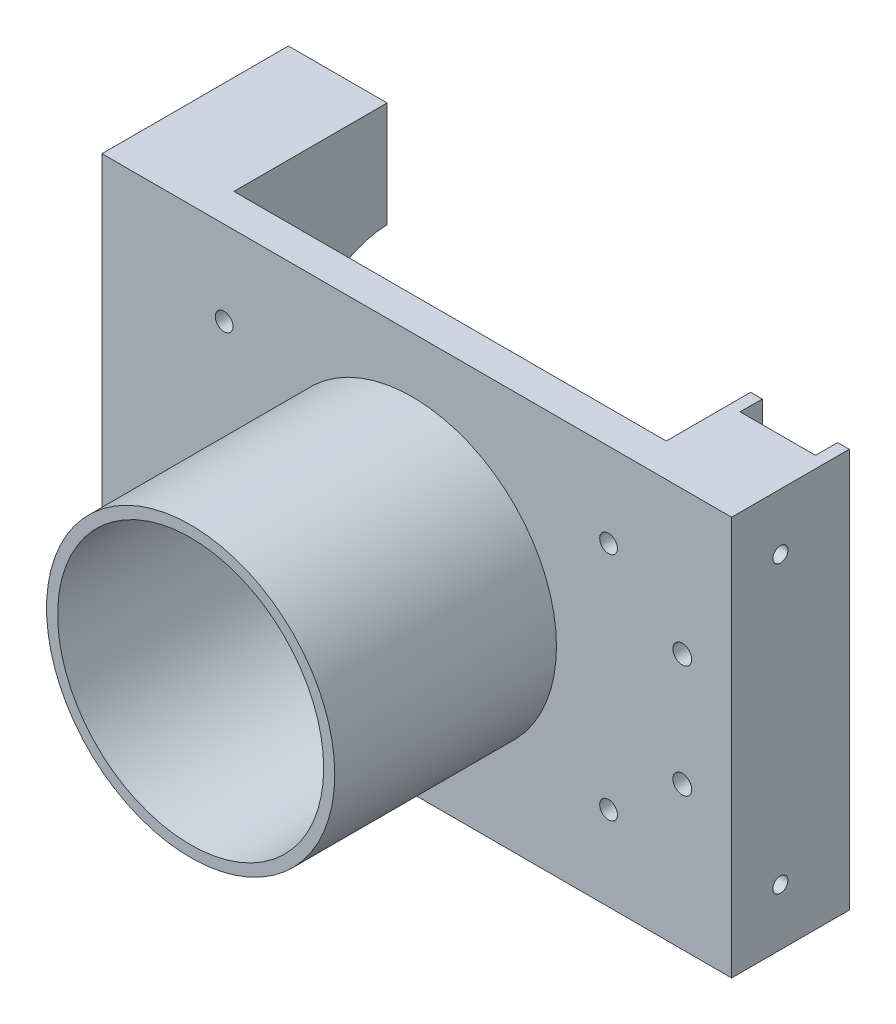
ISO-10303-21;
HEADER;
FILE_DESCRIPTION(('STEP AP214'),'2;1');
FILE_NAME('part.step','',(''),(''),'','','');
FILE_SCHEMA(('AUTOMOTIVE_DESIGN { 1 0 10303 214 1 1 1 1 }'));
ENDSEC;
DATA;
#1=APPLICATION_CONTEXT('core data for automotive mechanical design processes');
#2=APPLICATION_PROTOCOL_DEFINITION('international standard','automotive_design',2000,#1);
#3=PRODUCT_CONTEXT('',#1,'mechanical');
#4=PRODUCT('Part','Part','',(#3));
#5=PRODUCT_RELATED_PRODUCT_CATEGORY('part','',(#4));
#6=PRODUCT_DEFINITION_FORMATION('','',#4);
#7=PRODUCT_DEFINITION_CONTEXT('part definition',#1,'design');
#8=PRODUCT_DEFINITION('design','',#6,#7);
#9=PRODUCT_DEFINITION_SHAPE('','',#8);
#10=(LENGTH_UNIT() NAMED_UNIT(*) SI_UNIT(.MILLI.,.METRE.));
#11=(NAMED_UNIT(*) PLANE_ANGLE_UNIT() SI_UNIT($,.RADIAN.));
#12=(NAMED_UNIT(*) SI_UNIT($,.STERADIAN.) SOLID_ANGLE_UNIT());
#13=UNCERTAINTY_MEASURE_WITH_UNIT(LENGTH_MEASURE(1.E-05),#10,'distance_accuracy_value','');
#14=(GEOMETRIC_REPRESENTATION_CONTEXT(3) GLOBAL_UNCERTAINTY_ASSIGNED_CONTEXT((#13)) GLOBAL_UNIT_ASSIGNED_CONTEXT((#10,
#11,#12)) REPRESENTATION_CONTEXT('',''));
#15=CARTESIAN_POINT('',(0.,0.,0.));
#16=DIRECTION('',(0.,0.,1.));
#17=DIRECTION('',(1.,0.,0.));
#18=AXIS2_PLACEMENT_3D('',#15,#16,#17);
#19=CARTESIAN_POINT('',(140.,90.,153.07));
#20=DIRECTION('',(0.,0.,1.));
#21=DIRECTION('',(1.,0.,0.));
#22=AXIS2_PLACEMENT_3D('',#19,#20,#21);
#23=PLANE('',#22);
#24=CARTESIAN_POINT('',(140.,90.,153.07));
#25=DIRECTION('',(0.,0.,1.));
#26=DIRECTION('',(1.,0.,0.));
#27=AXIS2_PLACEMENT_3D('',#24,#25,#26);
#28=CIRCLE('',#27,65.);
#29=CARTESIAN_POINT('',(205.,90.,153.07));
#30=VERTEX_POINT('',#29);
#31=EDGE_CURVE('E12',#30,#30,#28,.T.);
#32=ORIENTED_EDGE('',*,*,#31,.T.);
#33=EDGE_LOOP('',(#32));
#34=FACE_BOUND('',#33,.T.);
#35=CARTESIAN_POINT('',(140.,90.,153.07));
#36=DIRECTION('',(0.,0.,1.));
#37=DIRECTION('',(1.,0.,0.));
#38=AXIS2_PLACEMENT_3D('',#35,#36,#37);
#39=CIRCLE('',#38,60.);
#40=CARTESIAN_POINT('',(200.,90.,153.07));
#41=VERTEX_POINT('',#40);
#42=EDGE_CURVE('E63',#41,#41,#39,.T.);
#43=ORIENTED_EDGE('',*,*,#42,.F.);
#44=EDGE_LOOP('',(#43));
#45=FACE_BOUND('',#44,.T.);
#46=ADVANCED_FACE('F50',(#34,#45),#23,.T.);
#47=CARTESIAN_POINT('',(140.,90.,53.07));
#48=DIRECTION('',(0.,0.,1.));
#49=DIRECTION('',(1.,0.,0.));
#50=AXIS2_PLACEMENT_3D('',#47,#48,#49);
#51=PLANE('',#50);
#52=CARTESIAN_POINT('',(140.,90.,53.07));
#53=DIRECTION('',(0.,0.,1.));
#54=DIRECTION('',(1.,0.,0.));
#55=AXIS2_PLACEMENT_3D('',#52,#53,#54);
#56=CIRCLE('',#55,65.);
#57=CARTESIAN_POINT('',(205.,90.,53.07));
#58=VERTEX_POINT('',#57);
#59=EDGE_CURVE('E58',#58,#58,#56,.T.);
#60=ORIENTED_EDGE('',*,*,#59,.F.);
#61=EDGE_LOOP('',(#60));
#62=FACE_BOUND('',#61,.T.);
#63=CARTESIAN_POINT('',(140.,90.,53.07));
#64=DIRECTION('',(0.,0.,1.));
#65=DIRECTION('',(1.,0.,0.));
#66=AXIS2_PLACEMENT_3D('',#63,#64,#65);
#67=CIRCLE('',#66,58.2544935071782);
#68=CARTESIAN_POINT('',(198.254493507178,90.,53.07));
#69=VERTEX_POINT('',#68);
#70=EDGE_CURVE('E54',#69,#69,#67,.T.);
#71=ORIENTED_EDGE('',*,*,#70,.T.);
#72=EDGE_LOOP('',(#71));
#73=FACE_BOUND('',#72,.T.);
#74=ADVANCED_FACE('F71',(#62,#73),#51,.F.);
#75=CARTESIAN_POINT('',(140.,90.,153.07));
#76=DIRECTION('',(0.,0.,-1.));
#77=DIRECTION('',(-1.,0.,0.));
#78=AXIS2_PLACEMENT_3D('',#75,#76,#77);
#79=CYLINDRICAL_SURFACE('',#78,65.);
#80=ORIENTED_EDGE('',*,*,#31,.F.);
#81=EDGE_LOOP('',(#80));
#82=FACE_BOUND('',#81,.T.);
#83=ORIENTED_EDGE('',*,*,#59,.T.);
#84=EDGE_LOOP('',(#83));
#85=FACE_BOUND('',#84,.T.);
#86=ADVANCED_FACE('F74',(#82,#85),#79,.T.);
#87=CARTESIAN_POINT('',(140.,90.,153.07));
#88=DIRECTION('',(0.,0.,1.));
#89=DIRECTION('',(1.,0.,0.));
#90=AXIS2_PLACEMENT_3D('',#87,#88,#89);
#91=CONICAL_SURFACE('',#90,60.,0.0174532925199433);
#92=ORIENTED_EDGE('',*,*,#42,.T.);
#93=EDGE_LOOP('',(#92));
#94=FACE_BOUND('',#93,.T.);
#95=ORIENTED_EDGE('',*,*,#70,.F.);
#96=EDGE_LOOP('',(#95));
#97=FACE_BOUND('',#96,.T.);
#98=ADVANCED_FACE('F52',(#94,#97),#91,.F.);
#99=CLOSED_SHELL('',(#46,#74,#86,#98));
#100=MANIFOLD_SOLID_BREP('B2',#99);
#101=CARTESIAN_POINT('',(284.001025,90.,-32.93));
#102=DIRECTION('',(-1.,0.,0.));
#103=DIRECTION('',(0.,0.,1.));
#104=AXIS2_PLACEMENT_3D('',#101,#102,#103);
#105=CYLINDRICAL_SURFACE('',#104,42.5);
#106=CARTESIAN_POINT('',(0.,90.,-32.93));
#107=DIRECTION('',(-1.,0.,0.));
#108=DIRECTION('',(0.,0.,1.));
#109=AXIS2_PLACEMENT_3D('',#106,#107,#108);
#110=CIRCLE('',#109,42.5);
#111=CARTESIAN_POINT('',(0.,47.5422683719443,-31.035));
#112=VERTEX_POINT('',#111);
#113=CARTESIAN_POINT('',(0.,85.,9.27485754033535));
#114=VERTEX_POINT('',#113);
#115=EDGE_CURVE('E327',#112,#114,#110,.T.);
#116=ORIENTED_EDGE('',*,*,#115,.T.);
#117=DIRECTION('',(-1.,0.,0.));
#118=VECTOR('',#117,1.);
#119=CARTESIAN_POINT('',(284.001025,85.,9.27485754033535));
#120=LINE('',#119,#118);
#121=CARTESIAN_POINT('',(44.5,85.,9.27485754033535));
#122=VERTEX_POINT('',#121);
#123=EDGE_CURVE('E297',#122,#114,#120,.T.);
#124=ORIENTED_EDGE('',*,*,#123,.F.);
#125=CARTESIAN_POINT('',(44.5,90.,-32.93));
#126=DIRECTION('',(-1.,0.,0.));
#127=DIRECTION('',(0.,-1.,0.));
#128=AXIS2_PLACEMENT_3D('',#125,#126,#127);
#129=CIRCLE('',#128,42.5);
#130=CARTESIAN_POINT('',(44.5,47.5422683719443,-31.035));
#131=VERTEX_POINT('',#130);
#132=EDGE_CURVE('E326',#122,#131,#129,.F.);
#133=ORIENTED_EDGE('',*,*,#132,.T.);
#134=DIRECTION('',(-1.,0.,0.));
#135=VECTOR('',#134,1.);
#136=CARTESIAN_POINT('',(284.001025,47.5422683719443,-31.035));
#137=LINE('',#136,#135);
#138=EDGE_CURVE('E330',#112,#131,#137,.F.);
#139=ORIENTED_EDGE('',*,*,#138,.F.);
#140=EDGE_LOOP('',(#116,#124,#133,#139));
#141=FACE_BOUND('',#140,.T.);
#142=ADVANCED_FACE('F112',(#141),#105,.F.);
#143=CARTESIAN_POINT('',(227.155881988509,180.,-31.035));
#144=DIRECTION('',(0.,0.,-1.));
#145=DIRECTION('',(0.,1.,0.));
#146=AXIS2_PLACEMENT_3D('',#143,#144,#145);
#147=PLANE('',#146);
#148=CARTESIAN_POINT('',(22.25,23.7722683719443,-31.035));
#149=DIRECTION('',(0.,0.,-1.));
#150=DIRECTION('',(0.,1.,0.));
#151=AXIS2_PLACEMENT_3D('',#148,#149,#150);
#152=CIRCLE('',#151,3.4);
#153=CARTESIAN_POINT('',(22.25,27.1722683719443,-31.035));
#154=VERTEX_POINT('',#153);
#155=EDGE_CURVE('E284',#154,#154,#152,.T.);
#156=ORIENTED_EDGE('',*,*,#155,.F.);
#157=EDGE_LOOP('',(#156));
#158=FACE_BOUND('',#157,.T.);
#159=ORIENTED_EDGE('',*,*,#138,.T.);
#160=DIRECTION('',(0.,1.,0.));
#161=VECTOR('',#160,1.);
#162=CARTESIAN_POINT('',(44.5,180.,-31.035));
#163=LINE('',#162,#161);
#164=CARTESIAN_POINT('',(44.5,0.,-31.035));
#165=VERTEX_POINT('',#164);
#166=EDGE_CURVE('E335',#165,#131,#163,.T.);
#167=ORIENTED_EDGE('',*,*,#166,.F.);
#168=DIRECTION('',(-1.,0.,0.));
#169=VECTOR('',#168,1.);
#170=CARTESIAN_POINT('',(227.155881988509,0.,-31.035));
#171=LINE('',#170,#169);
#172=CARTESIAN_POINT('',(0.,0.,-31.035));
#173=VERTEX_POINT('',#172);
#174=EDGE_CURVE('E416',#165,#173,#171,.T.);
#175=ORIENTED_EDGE('',*,*,#174,.T.);
#176=DIRECTION('',(0.,-1.,0.));
#177=VECTOR('',#176,1.);
#178=CARTESIAN_POINT('',(0.,180.,-31.035));
#179=LINE('',#178,#177);
#180=EDGE_CURVE('E325',#112,#173,#179,.T.);
#181=ORIENTED_EDGE('',*,*,#180,.F.);
#182=EDGE_LOOP('',(#159,#167,#175,#181));
#183=FACE_BOUND('',#182,.T.);
#184=ADVANCED_FACE('F423',(#158,#183),#147,.T.);
#185=CARTESIAN_POINT('',(0.,0.,53.07));
#186=DIRECTION('',(1.,0.,0.));
#187=DIRECTION('',(0.,0.,-1.));
#188=AXIS2_PLACEMENT_3D('',#185,#186,#187);
#189=PLANE('',#188);
#190=DIRECTION('',(0.,1.,0.));
#191=VECTOR('',#190,1.);
#192=CARTESIAN_POINT('',(0.,95.,14.2748575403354));
#193=LINE('',#192,#191);
#194=CARTESIAN_POINT('',(0.,85.,14.2748575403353));
#195=VERTEX_POINT('',#194);
#196=CARTESIAN_POINT('',(0.,95.,14.2748575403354));
#197=VERTEX_POINT('',#196);
#198=EDGE_CURVE('E312',#195,#197,#193,.T.);
#199=ORIENTED_EDGE('',*,*,#198,.F.);
#200=DIRECTION('',(0.,0.,1.));
#201=VECTOR('',#200,1.);
#202=CARTESIAN_POINT('',(0.,85.,9.27485754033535));
#203=LINE('',#202,#201);
#204=EDGE_CURVE('E309',#114,#195,#203,.T.);
#205=ORIENTED_EDGE('',*,*,#204,.F.);
#206=ORIENTED_EDGE('',*,*,#115,.F.);
#207=ORIENTED_EDGE('',*,*,#180,.T.);
#208=DIRECTION('',(0.,0.,-1.));
#209=VECTOR('',#208,1.);
#210=CARTESIAN_POINT('',(0.,0.,53.07));
#211=LINE('',#210,#209);
#212=CARTESIAN_POINT('',(0.,0.,53.07));
#213=VERTEX_POINT('',#212);
#214=EDGE_CURVE('E121',#213,#173,#211,.T.);
#215=ORIENTED_EDGE('',*,*,#214,.F.);
#216=DIRECTION('',(0.,-1.,0.));
#217=VECTOR('',#216,1.);
#218=CARTESIAN_POINT('',(0.,0.,53.07));
#219=LINE('',#218,#217);
#220=CARTESIAN_POINT('',(0.,180.,53.07));
#221=VERTEX_POINT('',#220);
#222=EDGE_CURVE('E386',#221,#213,#219,.T.);
#223=ORIENTED_EDGE('',*,*,#222,.F.);
#224=DIRECTION('',(0.,0.,-1.));
#225=VECTOR('',#224,1.);
#226=CARTESIAN_POINT('',(0.,180.,53.07));
#227=LINE('',#226,#225);
#228=CARTESIAN_POINT('',(0.,180.,-31.035));
#229=VERTEX_POINT('',#228);
#230=EDGE_CURVE('E395',#221,#229,#227,.T.);
#231=ORIENTED_EDGE('',*,*,#230,.T.);
#232=CARTESIAN_POINT('',(0.,132.457731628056,-31.035));
#233=VERTEX_POINT('',#232);
#234=EDGE_CURVE('E342',#229,#233,#179,.T.);
#235=ORIENTED_EDGE('',*,*,#234,.T.);
#236=CARTESIAN_POINT('',(0.,95.,9.27485754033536));
#237=VERTEX_POINT('',#236);
#238=EDGE_CURVE('E136',#237,#233,#110,.T.);
#239=ORIENTED_EDGE('',*,*,#238,.F.);
#240=DIRECTION('',(0.,0.,-1.));
#241=VECTOR('',#240,1.);
#242=CARTESIAN_POINT('',(0.,95.,9.27485754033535));
#243=LINE('',#242,#241);
#244=EDGE_CURVE('E129',#197,#237,#243,.T.);
#245=ORIENTED_EDGE('',*,*,#244,.F.);
#246=EDGE_LOOP('',(#199,#205,#206,#207,#215,#223,#231,#235,#239,#245));
#247=FACE_BOUND('',#246,.T.);
#248=ADVANCED_FACE('F114',(#247),#189,.F.);
#249=CARTESIAN_POINT('',(0.,0.,53.07));
#250=DIRECTION('',(0.,1.,0.));
#251=DIRECTION('',(0.,0.,1.));
#252=AXIS2_PLACEMENT_3D('',#249,#250,#251);
#253=PLANE('',#252);
#254=ORIENTED_EDGE('',*,*,#214,.T.);
#255=ORIENTED_EDGE('',*,*,#174,.F.);
#256=DIRECTION('',(0.,0.,-1.));
#257=VECTOR('',#256,1.);
#258=CARTESIAN_POINT('',(44.5,0.,0.));
#259=LINE('',#258,#257);
#260=CARTESIAN_POINT('',(44.5,0.,0.));
#261=VERTEX_POINT('',#260);
#262=EDGE_CURVE('E338',#261,#165,#259,.T.);
#263=ORIENTED_EDGE('',*,*,#262,.F.);
#264=DIRECTION('',(1.,0.,0.));
#265=VECTOR('',#264,1.);
#266=CARTESIAN_POINT('',(0.,0.,0.));
#267=LINE('',#266,#265);
#268=CARTESIAN_POINT('',(284.,0.,0.));
#269=VERTEX_POINT('',#268);
#270=EDGE_CURVE('E346',#261,#269,#267,.T.);
#271=ORIENTED_EDGE('',*,*,#270,.T.);
#272=DIRECTION('',(0.,0.,-1.));
#273=VECTOR('',#272,1.);
#274=CARTESIAN_POINT('',(284.,0.,53.07));
#275=LINE('',#274,#273);
#276=CARTESIAN_POINT('',(284.,0.,53.07));
#277=VERTEX_POINT('',#276);
#278=EDGE_CURVE('E407',#277,#269,#275,.T.);
#279=ORIENTED_EDGE('',*,*,#278,.F.);
#280=DIRECTION('',(1.,0.,0.));
#281=VECTOR('',#280,1.);
#282=CARTESIAN_POINT('',(0.,0.,53.07));
#283=LINE('',#282,#281);
#284=EDGE_CURVE('E389',#213,#277,#283,.T.);
#285=ORIENTED_EDGE('',*,*,#284,.F.);
#286=EDGE_LOOP('',(#254,#255,#263,#271,#279,#285));
#287=FACE_BOUND('',#286,.T.);
#288=ADVANCED_FACE('F414',(#287),#253,.F.);
#289=CARTESIAN_POINT('',(284.,0.,53.07));
#290=DIRECTION('',(-1.,0.,0.));
#291=DIRECTION('',(0.,0.,1.));
#292=AXIS2_PLACEMENT_3D('',#289,#290,#291);
#293=PLANE('',#292);
#294=CARTESIAN_POINT('',(284.,25.5,31.07));
#295=DIRECTION('',(1.,0.,0.));
#296=DIRECTION('',(0.,0.,-1.));
#297=AXIS2_PLACEMENT_3D('',#294,#295,#296);
#298=CIRCLE('',#297,3.4);
#299=CARTESIAN_POINT('',(284.,25.5,27.67));
#300=VERTEX_POINT('',#299);
#301=EDGE_CURVE('E264',#300,#300,#298,.T.);
#302=ORIENTED_EDGE('',*,*,#301,.F.);
#303=EDGE_LOOP('',(#302));
#304=FACE_BOUND('',#303,.T.);
#305=CARTESIAN_POINT('',(284.,154.5,31.07));
#306=DIRECTION('',(1.,0.,0.));
#307=DIRECTION('',(0.,0.,-1.));
#308=AXIS2_PLACEMENT_3D('',#305,#306,#307);
#309=CIRCLE('',#308,3.39999999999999);
#310=CARTESIAN_POINT('',(284.,154.5,27.67));
#311=VERTEX_POINT('',#310);
#312=EDGE_CURVE('E272',#311,#311,#309,.T.);
#313=ORIENTED_EDGE('',*,*,#312,.F.);
#314=EDGE_LOOP('',(#313));
#315=FACE_BOUND('',#314,.T.);
#316=DIRECTION('',(0.,1.,0.));
#317=VECTOR('',#316,1.);
#318=CARTESIAN_POINT('',(284.,0.,0.));
#319=LINE('',#318,#317);
#320=CARTESIAN_POINT('',(284.,180.,0.));
#321=VERTEX_POINT('',#320);
#322=EDGE_CURVE('E398',#269,#321,#319,.T.);
#323=ORIENTED_EDGE('',*,*,#322,.T.);
#324=DIRECTION('',(0.,0.,-1.));
#325=VECTOR('',#324,1.);
#326=CARTESIAN_POINT('',(284.,180.,53.07));
#327=LINE('',#326,#325);
#328=CARTESIAN_POINT('',(284.,180.,53.07));
#329=VERTEX_POINT('',#328);
#330=EDGE_CURVE('E404',#329,#321,#327,.T.);
#331=ORIENTED_EDGE('',*,*,#330,.F.);
#332=DIRECTION('',(0.,1.,0.));
#333=VECTOR('',#332,1.);
#334=CARTESIAN_POINT('',(284.,0.,53.07));
#335=LINE('',#334,#333);
#336=EDGE_CURVE('E392',#277,#329,#335,.T.);
#337=ORIENTED_EDGE('',*,*,#336,.F.);
#338=ORIENTED_EDGE('',*,*,#278,.T.);
#339=EDGE_LOOP('',(#323,#331,#337,#338));
#340=FACE_BOUND('',#339,.T.);
#341=ADVANCED_FACE('F510',(#304,#315,#340),#293,.F.);
#342=CARTESIAN_POINT('',(0.,180.,53.07));
#343=DIRECTION('',(0.,-1.,0.));
#344=DIRECTION('',(0.,0.,-1.));
#345=AXIS2_PLACEMENT_3D('',#342,#343,#344);
#346=PLANE('',#345);
#347=DIRECTION('',(-1.,0.,0.));
#348=VECTOR('',#347,1.);
#349=CARTESIAN_POINT('',(0.,180.,0.));
#350=LINE('',#349,#348);
#351=CARTESIAN_POINT('',(278.75,180.,0.));
#352=VERTEX_POINT('',#351);
#353=EDGE_CURVE('E390',#321,#352,#350,.T.);
#354=ORIENTED_EDGE('',*,*,#353,.T.);
#355=DIRECTION('',(0.,0.,-1.));
#356=VECTOR('',#355,1.);
#357=CARTESIAN_POINT('',(278.75,180.,10.));
#358=LINE('',#357,#356);
#359=CARTESIAN_POINT('',(278.75,180.,10.));
#360=VERTEX_POINT('',#359);
#361=EDGE_CURVE('E447',#360,#352,#358,.T.);
#362=ORIENTED_EDGE('',*,*,#361,.F.);
#363=DIRECTION('',(1.,0.,0.));
#364=VECTOR('',#363,1.);
#365=CARTESIAN_POINT('',(278.75,180.,10.));
#366=LINE('',#365,#364);
#367=CARTESIAN_POINT('',(244.75,180.,10.));
#368=VERTEX_POINT('',#367);
#369=EDGE_CURVE('E438',#368,#360,#366,.T.);
#370=ORIENTED_EDGE('',*,*,#369,.F.);
#371=DIRECTION('',(0.,0.,-1.));
#372=VECTOR('',#371,1.);
#373=CARTESIAN_POINT('',(244.75,180.,10.));
#374=LINE('',#373,#372);
#375=CARTESIAN_POINT('',(244.75,180.,0.));
#376=VERTEX_POINT('',#375);
#377=EDGE_CURVE('E450',#368,#376,#374,.T.);
#378=ORIENTED_EDGE('',*,*,#377,.T.);
#379=CARTESIAN_POINT('',(239.5,180.,0.));
#380=VERTEX_POINT('',#379);
#381=EDGE_CURVE('E400',#376,#380,#350,.T.);
#382=ORIENTED_EDGE('',*,*,#381,.T.);
#383=DIRECTION('',(0.,0.,-1.));
#384=VECTOR('',#383,1.);
#385=CARTESIAN_POINT('',(239.5,180.,38.07));
#386=LINE('',#385,#384);
#387=CARTESIAN_POINT('',(239.5,180.,38.07));
#388=VERTEX_POINT('',#387);
#389=EDGE_CURVE('E381',#388,#380,#386,.T.);
#390=ORIENTED_EDGE('',*,*,#389,.F.);
#391=DIRECTION('',(1.,0.,0.));
#392=VECTOR('',#391,1.);
#393=CARTESIAN_POINT('',(44.5,180.,38.07));
#394=LINE('',#393,#392);
#395=CARTESIAN_POINT('',(44.5,180.,38.07));
#396=VERTEX_POINT('',#395);
#397=EDGE_CURVE('E365',#396,#388,#394,.T.);
#398=ORIENTED_EDGE('',*,*,#397,.F.);
#399=DIRECTION('',(0.,0.,-1.));
#400=VECTOR('',#399,1.);
#401=CARTESIAN_POINT('',(44.5,180.,38.07));
#402=LINE('',#401,#400);
#403=CARTESIAN_POINT('',(44.5,180.,-31.035));
#404=VERTEX_POINT('',#403);
#405=EDGE_CURVE('E383',#396,#404,#402,.T.);
#406=ORIENTED_EDGE('',*,*,#405,.T.);
#407=DIRECTION('',(-1.,0.,0.));
#408=VECTOR('',#407,1.);
#409=CARTESIAN_POINT('',(227.155881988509,180.,-31.035));
#410=LINE('',#409,#408);
#411=EDGE_CURVE('E424',#404,#229,#410,.T.);
#412=ORIENTED_EDGE('',*,*,#411,.T.);
#413=ORIENTED_EDGE('',*,*,#230,.F.);
#414=DIRECTION('',(-1.,0.,0.));
#415=VECTOR('',#414,1.);
#416=CARTESIAN_POINT('',(0.,180.,53.07));
#417=LINE('',#416,#415);
#418=EDGE_CURVE('E394',#329,#221,#417,.T.);
#419=ORIENTED_EDGE('',*,*,#418,.F.);
#420=ORIENTED_EDGE('',*,*,#330,.T.);
#421=EDGE_LOOP('',(#354,#362,#370,#378,#382,#390,#398,#406,#412,#413,#419,#420));
#422=FACE_BOUND('',#421,.T.);
#423=ADVANCED_FACE('F493',(#422),#346,.F.);
#424=CARTESIAN_POINT('',(0.,180.,53.07));
#425=DIRECTION('',(0.,0.,-1.));
#426=DIRECTION('',(-1.,0.,0.));
#427=AXIS2_PLACEMENT_3D('',#424,#425,#426);
#428=PLANE('',#427);
#429=CARTESIAN_POINT('',(261.75,64.6,53.07));
#430=DIRECTION('',(0.,0.,1.));
#431=DIRECTION('',(1.,0.,0.));
#432=AXIS2_PLACEMENT_3D('',#429,#430,#431);
#433=CIRCLE('',#432,4.24999999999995);
#434=CARTESIAN_POINT('',(266.,64.6,53.07));
#435=VERTEX_POINT('',#434);
#436=EDGE_CURVE('E288',#435,#435,#433,.T.);
#437=ORIENTED_EDGE('',*,*,#436,.F.);
#438=EDGE_LOOP('',(#437));
#439=FACE_BOUND('',#438,.T.);
#440=CARTESIAN_POINT('',(261.75,115.4,53.07));
#441=DIRECTION('',(0.,0.,1.));
#442=DIRECTION('',(1.,0.,0.));
#443=AXIS2_PLACEMENT_3D('',#440,#441,#442);
#444=CIRCLE('',#443,4.24999999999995);
#445=CARTESIAN_POINT('',(266.,115.4,53.07));
#446=VERTEX_POINT('',#445);
#447=EDGE_CURVE('E294',#446,#446,#444,.T.);
#448=ORIENTED_EDGE('',*,*,#447,.F.);
#449=EDGE_LOOP('',(#448));
#450=FACE_BOUND('',#449,.T.);
#451=CARTESIAN_POINT('',(228.5,38.,53.07));
#452=DIRECTION('',(0.,0.,1.));
#453=DIRECTION('',(1.,0.,0.));
#454=AXIS2_PLACEMENT_3D('',#451,#452,#453);
#455=CIRCLE('',#454,4.);
#456=CARTESIAN_POINT('',(232.5,38.,53.07));
#457=VERTEX_POINT('',#456);
#458=EDGE_CURVE('E449',#457,#457,#455,.T.);
#459=ORIENTED_EDGE('',*,*,#458,.F.);
#460=EDGE_LOOP('',(#459));
#461=FACE_BOUND('',#460,.T.);
#462=CARTESIAN_POINT('',(228.5,142.,53.07));
#463=DIRECTION('',(0.,0.,1.));
#464=DIRECTION('',(1.,0.,0.));
#465=AXIS2_PLACEMENT_3D('',#462,#463,#464);
#466=CIRCLE('',#465,4.);
#467=CARTESIAN_POINT('',(232.5,142.,53.07));
#468=VERTEX_POINT('',#467);
#469=EDGE_CURVE('E462',#468,#468,#466,.T.);
#470=ORIENTED_EDGE('',*,*,#469,.F.);
#471=EDGE_LOOP('',(#470));
#472=FACE_BOUND('',#471,.T.);
#473=CARTESIAN_POINT('',(55.1,38.,53.07));
#474=DIRECTION('',(0.,0.,1.));
#475=DIRECTION('',(1.,0.,0.));
#476=AXIS2_PLACEMENT_3D('',#473,#474,#475);
#477=CIRCLE('',#476,4.);
#478=CARTESIAN_POINT('',(59.1,38.,53.07));
#479=VERTEX_POINT('',#478);
#480=EDGE_CURVE('E468',#479,#479,#477,.T.);
#481=ORIENTED_EDGE('',*,*,#480,.F.);
#482=EDGE_LOOP('',(#481));
#483=FACE_BOUND('',#482,.T.);
#484=CARTESIAN_POINT('',(55.1,142.,53.07));
#485=DIRECTION('',(0.,0.,1.));
#486=DIRECTION('',(1.,0.,0.));
#487=AXIS2_PLACEMENT_3D('',#484,#485,#486);
#488=CIRCLE('',#487,4.);
#489=CARTESIAN_POINT('',(59.1,142.,53.07));
#490=VERTEX_POINT('',#489);
#491=EDGE_CURVE('E374',#490,#490,#488,.T.);
#492=ORIENTED_EDGE('',*,*,#491,.F.);
#493=EDGE_LOOP('',(#492));
#494=FACE_BOUND('',#493,.T.);
#495=ORIENTED_EDGE('',*,*,#222,.T.);
#496=ORIENTED_EDGE('',*,*,#284,.T.);
#497=ORIENTED_EDGE('',*,*,#336,.T.);
#498=ORIENTED_EDGE('',*,*,#418,.T.);
#499=EDGE_LOOP('',(#495,#496,#497,#498));
#500=FACE_BOUND('',#499,.T.);
#501=ADVANCED_FACE('F520',(#439,#450,#461,#472,#483,#494,#500),#428,.F.);
#502=CARTESIAN_POINT('',(0.,180.,0.));
#503=DIRECTION('',(0.,0.,-1.));
#504=DIRECTION('',(-1.,0.,0.));
#505=AXIS2_PLACEMENT_3D('',#502,#503,#504);
#506=PLANE('',#505);
#507=DIRECTION('',(0.,-1.,0.));
#508=VECTOR('',#507,1.);
#509=CARTESIAN_POINT('',(44.5,180.,0.));
#510=LINE('',#509,#508);
#511=CARTESIAN_POINT('',(44.5,18.,0.));
#512=VERTEX_POINT('',#511);
#513=EDGE_CURVE('E48',#512,#261,#510,.T.);
#514=ORIENTED_EDGE('',*,*,#513,.F.);
#515=DIRECTION('',(-1.,0.,0.));
#516=VECTOR('',#515,1.);
#517=CARTESIAN_POINT('',(44.5,18.,0.));
#518=LINE('',#517,#516);
#519=CARTESIAN_POINT('',(239.5,18.,0.));
#520=VERTEX_POINT('',#519);
#521=EDGE_CURVE('E358',#520,#512,#518,.T.);
#522=ORIENTED_EDGE('',*,*,#521,.F.);
#523=DIRECTION('',(0.,-1.,0.));
#524=VECTOR('',#523,1.);
#525=CARTESIAN_POINT('',(239.5,180.,0.));
#526=LINE('',#525,#524);
#527=EDGE_CURVE('E361',#380,#520,#526,.T.);
#528=ORIENTED_EDGE('',*,*,#527,.F.);
#529=ORIENTED_EDGE('',*,*,#381,.F.);
#530=DIRECTION('',(0.,1.,0.));
#531=VECTOR('',#530,1.);
#532=CARTESIAN_POINT('',(244.75,180.,0.));
#533=LINE('',#532,#531);
#534=CARTESIAN_POINT('',(244.75,40.,0.));
#535=VERTEX_POINT('',#534);
#536=EDGE_CURVE('E432',#535,#376,#533,.T.);
#537=ORIENTED_EDGE('',*,*,#536,.F.);
#538=DIRECTION('',(-1.,0.,0.));
#539=VECTOR('',#538,1.);
#540=CARTESIAN_POINT('',(278.75,40.,0.));
#541=LINE('',#540,#539);
#542=CARTESIAN_POINT('',(278.75,40.,0.));
#543=VERTEX_POINT('',#542);
#544=EDGE_CURVE('E443',#543,#535,#541,.T.);
#545=ORIENTED_EDGE('',*,*,#544,.F.);
#546=DIRECTION('',(0.,-1.,0.));
#547=VECTOR('',#546,1.);
#548=CARTESIAN_POINT('',(278.75,180.,0.));
#549=LINE('',#548,#547);
#550=EDGE_CURVE('E350',#352,#543,#549,.T.);
#551=ORIENTED_EDGE('',*,*,#550,.F.);
#552=ORIENTED_EDGE('',*,*,#353,.F.);
#553=ORIENTED_EDGE('',*,*,#322,.F.);
#554=ORIENTED_EDGE('',*,*,#270,.F.);
#555=EDGE_LOOP('',(#514,#522,#528,#529,#537,#545,#551,#552,#553,#554));
#556=FACE_BOUND('',#555,.T.);
#557=ADVANCED_FACE('F513',(#556),#506,.T.);
#558=CARTESIAN_POINT('',(44.5,180.,38.07));
#559=DIRECTION('',(-1.,0.,0.));
#560=DIRECTION('',(0.,-1.,0.));
#561=AXIS2_PLACEMENT_3D('',#558,#559,#560);
#562=PLANE('',#561);
#563=ORIENTED_EDGE('',*,*,#132,.F.);
#564=DIRECTION('',(0.,0.,-1.));
#565=VECTOR('',#564,1.);
#566=CARTESIAN_POINT('',(44.5,85.,9.27485754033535));
#567=LINE('',#566,#565);
#568=CARTESIAN_POINT('',(44.5,85.,14.2748575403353));
#569=VERTEX_POINT('',#568);
#570=EDGE_CURVE('E319',#569,#122,#567,.T.);
#571=ORIENTED_EDGE('',*,*,#570,.F.);
#572=DIRECTION('',(0.,-1.,0.));
#573=VECTOR('',#572,1.);
#574=CARTESIAN_POINT('',(44.5,95.,14.2748575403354));
#575=LINE('',#574,#573);
#576=CARTESIAN_POINT('',(44.5,95.,14.2748575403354));
#577=VERTEX_POINT('',#576);
#578=EDGE_CURVE('E303',#577,#569,#575,.T.);
#579=ORIENTED_EDGE('',*,*,#578,.F.);
#580=DIRECTION('',(0.,0.,1.));
#581=VECTOR('',#580,1.);
#582=CARTESIAN_POINT('',(44.5,95.,9.27485754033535));
#583=LINE('',#582,#581);
#584=CARTESIAN_POINT('',(44.5,95.,9.27485754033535));
#585=VERTEX_POINT('',#584);
#586=EDGE_CURVE('E306',#585,#577,#583,.T.);
#587=ORIENTED_EDGE('',*,*,#586,.F.);
#588=CARTESIAN_POINT('',(44.5,132.457731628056,-31.035));
#589=VERTEX_POINT('',#588);
#590=EDGE_CURVE('E322',#589,#585,#129,.F.);
#591=ORIENTED_EDGE('',*,*,#590,.F.);
#592=EDGE_CURVE('E339',#589,#404,#163,.T.);
#593=ORIENTED_EDGE('',*,*,#592,.T.);
#594=ORIENTED_EDGE('',*,*,#405,.F.);
#595=DIRECTION('',(0.,1.,0.));
#596=VECTOR('',#595,1.);
#597=CARTESIAN_POINT('',(44.5,180.,38.07));
#598=LINE('',#597,#596);
#599=CARTESIAN_POINT('',(44.5,18.,38.07));
#600=VERTEX_POINT('',#599);
#601=EDGE_CURVE('E360',#600,#396,#598,.T.);
#602=ORIENTED_EDGE('',*,*,#601,.F.);
#603=DIRECTION('',(0.,0.,-1.));
#604=VECTOR('',#603,1.);
#605=CARTESIAN_POINT('',(44.5,18.,38.07));
#606=LINE('',#605,#604);
#607=EDGE_CURVE('E353',#600,#512,#606,.T.);
#608=ORIENTED_EDGE('',*,*,#607,.T.);
#609=ORIENTED_EDGE('',*,*,#513,.T.);
#610=ORIENTED_EDGE('',*,*,#262,.T.);
#611=ORIENTED_EDGE('',*,*,#166,.T.);
#612=EDGE_LOOP('',(#563,#571,#579,#587,#591,#593,#594,#602,#608,#609,#610,#611));
#613=FACE_BOUND('',#612,.T.);
#614=ADVANCED_FACE('F488',(#613),#562,.F.);
#615=CARTESIAN_POINT('',(44.5,18.,38.07));
#616=DIRECTION('',(0.,-1.,0.));
#617=DIRECTION('',(1.,0.,0.));
#618=AXIS2_PLACEMENT_3D('',#615,#616,#617);
#619=PLANE('',#618);
#620=ORIENTED_EDGE('',*,*,#521,.T.);
#621=ORIENTED_EDGE('',*,*,#607,.F.);
#622=DIRECTION('',(-1.,0.,0.));
#623=VECTOR('',#622,1.);
#624=CARTESIAN_POINT('',(44.5,18.,38.07));
#625=LINE('',#624,#623);
#626=CARTESIAN_POINT('',(239.5,18.,38.07));
#627=VERTEX_POINT('',#626);
#628=EDGE_CURVE('E378',#627,#600,#625,.T.);
#629=ORIENTED_EDGE('',*,*,#628,.F.);
#630=DIRECTION('',(0.,0.,-1.));
#631=VECTOR('',#630,1.);
#632=CARTESIAN_POINT('',(239.5,18.,38.07));
#633=LINE('',#632,#631);
#634=EDGE_CURVE('E356',#627,#520,#633,.T.);
#635=ORIENTED_EDGE('',*,*,#634,.T.);
#636=EDGE_LOOP('',(#620,#621,#629,#635));
#637=FACE_BOUND('',#636,.T.);
#638=ADVANCED_FACE('F485',(#637),#619,.F.);
#639=CARTESIAN_POINT('',(239.5,180.,38.07));
#640=DIRECTION('',(1.,0.,0.));
#641=DIRECTION('',(0.,1.,0.));
#642=AXIS2_PLACEMENT_3D('',#639,#640,#641);
#643=PLANE('',#642);
#644=ORIENTED_EDGE('',*,*,#527,.T.);
#645=ORIENTED_EDGE('',*,*,#634,.F.);
#646=DIRECTION('',(0.,-1.,0.));
#647=VECTOR('',#646,1.);
#648=CARTESIAN_POINT('',(239.5,180.,38.07));
#649=LINE('',#648,#647);
#650=EDGE_CURVE('E477',#388,#627,#649,.T.);
#651=ORIENTED_EDGE('',*,*,#650,.F.);
#652=ORIENTED_EDGE('',*,*,#389,.T.);
#653=EDGE_LOOP('',(#644,#645,#651,#652));
#654=FACE_BOUND('',#653,.T.);
#655=ADVANCED_FACE('F726',(#654),#643,.F.);
#656=CARTESIAN_POINT('',(44.5,18.,38.07));
#657=DIRECTION('',(0.,0.,1.));
#658=DIRECTION('',(1.,0.,0.));
#659=AXIS2_PLACEMENT_3D('',#656,#657,#658);
#660=PLANE('',#659);
#661=CARTESIAN_POINT('',(228.5,38.,38.07));
#662=DIRECTION('',(0.,0.,1.));
#663=DIRECTION('',(1.,0.,0.));
#664=AXIS2_PLACEMENT_3D('',#661,#662,#663);
#665=CIRCLE('',#664,4.);
#666=CARTESIAN_POINT('',(232.5,38.,38.07));
#667=VERTEX_POINT('',#666);
#668=EDGE_CURVE('E459',#667,#667,#665,.F.);
#669=ORIENTED_EDGE('',*,*,#668,.F.);
#670=EDGE_LOOP('',(#669));
#671=FACE_BOUND('',#670,.T.);
#672=CARTESIAN_POINT('',(228.5,142.,38.07));
#673=DIRECTION('',(0.,0.,1.));
#674=DIRECTION('',(1.,0.,0.));
#675=AXIS2_PLACEMENT_3D('',#672,#673,#674);
#676=CIRCLE('',#675,4.);
#677=CARTESIAN_POINT('',(232.5,142.,38.07));
#678=VERTEX_POINT('',#677);
#679=EDGE_CURVE('E465',#678,#678,#676,.F.);
#680=ORIENTED_EDGE('',*,*,#679,.F.);
#681=EDGE_LOOP('',(#680));
#682=FACE_BOUND('',#681,.T.);
#683=CARTESIAN_POINT('',(55.1,38.,38.07));
#684=DIRECTION('',(0.,0.,1.));
#685=DIRECTION('',(1.,0.,0.));
#686=AXIS2_PLACEMENT_3D('',#683,#684,#685);
#687=CIRCLE('',#686,4.);
#688=CARTESIAN_POINT('',(59.1,38.,38.07));
#689=VERTEX_POINT('',#688);
#690=EDGE_CURVE('E471',#689,#689,#687,.F.);
#691=ORIENTED_EDGE('',*,*,#690,.F.);
#692=EDGE_LOOP('',(#691));
#693=FACE_BOUND('',#692,.T.);
#694=CARTESIAN_POINT('',(55.1,142.,38.07));
#695=DIRECTION('',(0.,0.,1.));
#696=DIRECTION('',(1.,0.,0.));
#697=AXIS2_PLACEMENT_3D('',#694,#695,#696);
#698=CIRCLE('',#697,4.);
#699=CARTESIAN_POINT('',(59.1,142.,38.07));
#700=VERTEX_POINT('',#699);
#701=EDGE_CURVE('E368',#700,#700,#698,.F.);
#702=ORIENTED_EDGE('',*,*,#701,.F.);
#703=EDGE_LOOP('',(#702));
#704=FACE_BOUND('',#703,.T.);
#705=ORIENTED_EDGE('',*,*,#601,.T.);
#706=ORIENTED_EDGE('',*,*,#397,.T.);
#707=ORIENTED_EDGE('',*,*,#650,.T.);
#708=ORIENTED_EDGE('',*,*,#628,.T.);
#709=EDGE_LOOP('',(#705,#706,#707,#708));
#710=FACE_BOUND('',#709,.T.);
#711=ADVANCED_FACE('F482',(#671,#682,#693,#704,#710),#660,.F.);
#712=CARTESIAN_POINT('',(55.1,142.,-0.001000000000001));
#713=DIRECTION('',(0.,0.,1.));
#714=DIRECTION('',(1.,0.,0.));
#715=AXIS2_PLACEMENT_3D('',#712,#713,#714);
#716=CYLINDRICAL_SURFACE('',#715,4.);
#717=ORIENTED_EDGE('',*,*,#491,.T.);
#718=EDGE_LOOP('',(#717));
#719=FACE_BOUND('',#718,.T.);
#720=ORIENTED_EDGE('',*,*,#701,.T.);
#721=EDGE_LOOP('',(#720));
#722=FACE_BOUND('',#721,.T.);
#723=ADVANCED_FACE('F742',(#719,#722),#716,.F.);
#724=CARTESIAN_POINT('',(55.1,38.,-0.001000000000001));
#725=DIRECTION('',(0.,0.,1.));
#726=DIRECTION('',(1.,0.,0.));
#727=AXIS2_PLACEMENT_3D('',#724,#725,#726);
#728=CYLINDRICAL_SURFACE('',#727,4.);
#729=ORIENTED_EDGE('',*,*,#480,.T.);
#730=EDGE_LOOP('',(#729));
#731=FACE_BOUND('',#730,.T.);
#732=ORIENTED_EDGE('',*,*,#690,.T.);
#733=EDGE_LOOP('',(#732));
#734=FACE_BOUND('',#733,.T.);
#735=ADVANCED_FACE('F752',(#731,#734),#728,.F.);
#736=CARTESIAN_POINT('',(228.5,142.,-0.001000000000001));
#737=DIRECTION('',(0.,0.,1.));
#738=DIRECTION('',(1.,0.,0.));
#739=AXIS2_PLACEMENT_3D('',#736,#737,#738);
#740=CYLINDRICAL_SURFACE('',#739,4.);
#741=ORIENTED_EDGE('',*,*,#469,.T.);
#742=EDGE_LOOP('',(#741));
#743=FACE_BOUND('',#742,.T.);
#744=ORIENTED_EDGE('',*,*,#679,.T.);
#745=EDGE_LOOP('',(#744));
#746=FACE_BOUND('',#745,.T.);
#747=ADVANCED_FACE('F760',(#743,#746),#740,.F.);
#748=CARTESIAN_POINT('',(228.5,38.,-0.001000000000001));
#749=DIRECTION('',(0.,0.,1.));
#750=DIRECTION('',(1.,0.,0.));
#751=AXIS2_PLACEMENT_3D('',#748,#749,#750);
#752=CYLINDRICAL_SURFACE('',#751,4.);
#753=ORIENTED_EDGE('',*,*,#458,.T.);
#754=EDGE_LOOP('',(#753));
#755=FACE_BOUND('',#754,.T.);
#756=ORIENTED_EDGE('',*,*,#668,.T.);
#757=EDGE_LOOP('',(#756));
#758=FACE_BOUND('',#757,.T.);
#759=ADVANCED_FACE('F768',(#755,#758),#752,.F.);
#760=CARTESIAN_POINT('',(278.75,180.,10.));
#761=DIRECTION('',(1.,0.,0.));
#762=DIRECTION('',(0.,1.,0.));
#763=AXIS2_PLACEMENT_3D('',#760,#761,#762);
#764=PLANE('',#763);
#765=ORIENTED_EDGE('',*,*,#550,.T.);
#766=DIRECTION('',(0.,0.,-1.));
#767=VECTOR('',#766,1.);
#768=CARTESIAN_POINT('',(278.75,40.,10.));
#769=LINE('',#768,#767);
#770=CARTESIAN_POINT('',(278.75,40.,10.));
#771=VERTEX_POINT('',#770);
#772=EDGE_CURVE('E441',#771,#543,#769,.T.);
#773=ORIENTED_EDGE('',*,*,#772,.F.);
#774=DIRECTION('',(0.,-1.,0.));
#775=VECTOR('',#774,1.);
#776=CARTESIAN_POINT('',(278.75,180.,10.));
#777=LINE('',#776,#775);
#778=EDGE_CURVE('E428',#360,#771,#777,.T.);
#779=ORIENTED_EDGE('',*,*,#778,.F.);
#780=ORIENTED_EDGE('',*,*,#361,.T.);
#781=EDGE_LOOP('',(#765,#773,#779,#780));
#782=FACE_BOUND('',#781,.T.);
#783=ADVANCED_FACE('F777',(#782),#764,.F.);
#784=CARTESIAN_POINT('',(244.75,180.,10.));
#785=DIRECTION('',(-1.,0.,0.));
#786=DIRECTION('',(0.,-1.,0.));
#787=AXIS2_PLACEMENT_3D('',#784,#785,#786);
#788=PLANE('',#787);
#789=ORIENTED_EDGE('',*,*,#536,.T.);
#790=ORIENTED_EDGE('',*,*,#377,.F.);
#791=DIRECTION('',(0.,1.,0.));
#792=VECTOR('',#791,1.);
#793=CARTESIAN_POINT('',(244.75,180.,10.));
#794=LINE('',#793,#792);
#795=CARTESIAN_POINT('',(244.75,40.,10.));
#796=VERTEX_POINT('',#795);
#797=EDGE_CURVE('E435',#796,#368,#794,.T.);
#798=ORIENTED_EDGE('',*,*,#797,.F.);
#799=DIRECTION('',(0.,0.,-1.));
#800=VECTOR('',#799,1.);
#801=CARTESIAN_POINT('',(244.75,40.,10.));
#802=LINE('',#801,#800);
#803=EDGE_CURVE('E453',#796,#535,#802,.T.);
#804=ORIENTED_EDGE('',*,*,#803,.T.);
#805=EDGE_LOOP('',(#789,#790,#798,#804));
#806=FACE_BOUND('',#805,.T.);
#807=ADVANCED_FACE('F786',(#806),#788,.F.);
#808=CARTESIAN_POINT('',(278.75,40.,10.));
#809=DIRECTION('',(0.,-1.,0.));
#810=DIRECTION('',(0.,0.,-1.));
#811=AXIS2_PLACEMENT_3D('',#808,#809,#810);
#812=PLANE('',#811);
#813=ORIENTED_EDGE('',*,*,#544,.T.);
#814=ORIENTED_EDGE('',*,*,#803,.F.);
#815=DIRECTION('',(-1.,0.,0.));
#816=VECTOR('',#815,1.);
#817=CARTESIAN_POINT('',(278.75,40.,10.));
#818=LINE('',#817,#816);
#819=EDGE_CURVE('E431',#771,#796,#818,.T.);
#820=ORIENTED_EDGE('',*,*,#819,.F.);
#821=ORIENTED_EDGE('',*,*,#772,.T.);
#822=EDGE_LOOP('',(#813,#814,#820,#821));
#823=FACE_BOUND('',#822,.T.);
#824=ADVANCED_FACE('F795',(#823),#812,.F.);
#825=CARTESIAN_POINT('',(278.75,40.,10.));
#826=DIRECTION('',(0.,0.,-1.));
#827=DIRECTION('',(-1.,0.,0.));
#828=AXIS2_PLACEMENT_3D('',#825,#826,#827);
#829=PLANE('',#828);
#830=CARTESIAN_POINT('',(261.75,64.6,10.));
#831=DIRECTION('',(0.,0.,-1.));
#832=DIRECTION('',(-1.,0.,0.));
#833=AXIS2_PLACEMENT_3D('',#830,#831,#832);
#834=CIRCLE('',#833,4.24999999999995);
#835=CARTESIAN_POINT('',(257.5,64.6,10.));
#836=VERTEX_POINT('',#835);
#837=EDGE_CURVE('E287',#836,#836,#834,.F.);
#838=ORIENTED_EDGE('',*,*,#837,.T.);
#839=EDGE_LOOP('',(#838));
#840=FACE_BOUND('',#839,.T.);
#841=CARTESIAN_POINT('',(261.75,115.4,10.));
#842=DIRECTION('',(0.,0.,-1.));
#843=DIRECTION('',(-1.,0.,0.));
#844=AXIS2_PLACEMENT_3D('',#841,#842,#843);
#845=CIRCLE('',#844,4.24999999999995);
#846=CARTESIAN_POINT('',(257.5,115.4,10.));
#847=VERTEX_POINT('',#846);
#848=EDGE_CURVE('E291',#847,#847,#845,.F.);
#849=ORIENTED_EDGE('',*,*,#848,.T.);
#850=EDGE_LOOP('',(#849));
#851=FACE_BOUND('',#850,.T.);
#852=ORIENTED_EDGE('',*,*,#778,.T.);
#853=ORIENTED_EDGE('',*,*,#819,.T.);
#854=ORIENTED_EDGE('',*,*,#797,.T.);
#855=ORIENTED_EDGE('',*,*,#369,.T.);
#856=EDGE_LOOP('',(#852,#853,#854,#855));
#857=FACE_BOUND('',#856,.T.);
#858=ADVANCED_FACE('F550',(#840,#851,#857),#829,.T.);
#859=CARTESIAN_POINT('',(22.25,156.232268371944,-31.035));
#860=DIRECTION('',(0.,0.,-1.));
#861=DIRECTION('',(0.,1.,0.));
#862=AXIS2_PLACEMENT_3D('',#859,#860,#861);
#863=CIRCLE('',#862,3.4);
#864=CARTESIAN_POINT('',(22.25,159.632268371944,-31.035));
#865=VERTEX_POINT('',#864);
#866=EDGE_CURVE('E278',#865,#865,#863,.T.);
#867=ORIENTED_EDGE('',*,*,#866,.F.);
#868=EDGE_LOOP('',(#867));
#869=FACE_BOUND('',#868,.T.);
#870=DIRECTION('',(-1.,0.,0.));
#871=VECTOR('',#870,1.);
#872=CARTESIAN_POINT('',(284.001025,132.457731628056,-31.035));
#873=LINE('',#872,#871);
#874=EDGE_CURVE('E333',#589,#233,#873,.T.);
#875=ORIENTED_EDGE('',*,*,#874,.T.);
#876=ORIENTED_EDGE('',*,*,#234,.F.);
#877=ORIENTED_EDGE('',*,*,#411,.F.);
#878=ORIENTED_EDGE('',*,*,#592,.F.);
#879=EDGE_LOOP('',(#875,#876,#877,#878));
#880=FACE_BOUND('',#879,.T.);
#881=ADVANCED_FACE('F498',(#869,#880),#147,.T.);
#882=ORIENTED_EDGE('',*,*,#590,.T.);
#883=DIRECTION('',(-1.,0.,0.));
#884=VECTOR('',#883,1.);
#885=CARTESIAN_POINT('',(284.001025,95.,9.27485754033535));
#886=LINE('',#885,#884);
#887=EDGE_CURVE('E301',#237,#585,#886,.F.);
#888=ORIENTED_EDGE('',*,*,#887,.F.);
#889=ORIENTED_EDGE('',*,*,#238,.T.);
#890=ORIENTED_EDGE('',*,*,#874,.F.);
#891=EDGE_LOOP('',(#882,#888,#889,#890));
#892=FACE_BOUND('',#891,.T.);
#893=ADVANCED_FACE('F535',(#892),#105,.F.);
#894=CARTESIAN_POINT('',(284.001025,85.,9.27485754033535));
#895=DIRECTION('',(0.,-1.,0.));
#896=DIRECTION('',(0.,0.,-1.));
#897=AXIS2_PLACEMENT_3D('',#894,#895,#896);
#898=PLANE('',#897);
#899=ORIENTED_EDGE('',*,*,#570,.T.);
#900=ORIENTED_EDGE('',*,*,#123,.T.);
#901=ORIENTED_EDGE('',*,*,#204,.T.);
#902=DIRECTION('',(-1.,0.,0.));
#903=VECTOR('',#902,1.);
#904=CARTESIAN_POINT('',(284.001025,85.,14.2748575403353));
#905=LINE('',#904,#903);
#906=EDGE_CURVE('E316',#569,#195,#905,.T.);
#907=ORIENTED_EDGE('',*,*,#906,.F.);
#908=EDGE_LOOP('',(#899,#900,#901,#907));
#909=FACE_BOUND('',#908,.T.);
#910=ADVANCED_FACE('F543',(#909),#898,.F.);
#911=CARTESIAN_POINT('',(284.001025,95.,14.2748575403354));
#912=DIRECTION('',(0.,0.,1.));
#913=DIRECTION('',(0.,-1.,0.));
#914=AXIS2_PLACEMENT_3D('',#911,#912,#913);
#915=PLANE('',#914);
#916=ORIENTED_EDGE('',*,*,#578,.T.);
#917=ORIENTED_EDGE('',*,*,#906,.T.);
#918=ORIENTED_EDGE('',*,*,#198,.T.);
#919=DIRECTION('',(-1.,0.,0.));
#920=VECTOR('',#919,1.);
#921=CARTESIAN_POINT('',(284.001025,95.,14.2748575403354));
#922=LINE('',#921,#920);
#923=EDGE_CURVE('E317',#577,#197,#922,.T.);
#924=ORIENTED_EDGE('',*,*,#923,.F.);
#925=EDGE_LOOP('',(#916,#917,#918,#924));
#926=FACE_BOUND('',#925,.T.);
#927=ADVANCED_FACE('F548',(#926),#915,.F.);
#928=CARTESIAN_POINT('',(284.001025,95.,9.27485754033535));
#929=DIRECTION('',(0.,1.,0.));
#930=DIRECTION('',(0.,0.,1.));
#931=AXIS2_PLACEMENT_3D('',#928,#929,#930);
#932=PLANE('',#931);
#933=ORIENTED_EDGE('',*,*,#586,.T.);
#934=ORIENTED_EDGE('',*,*,#923,.T.);
#935=ORIENTED_EDGE('',*,*,#244,.T.);
#936=ORIENTED_EDGE('',*,*,#887,.T.);
#937=EDGE_LOOP('',(#933,#934,#935,#936));
#938=FACE_BOUND('',#937,.T.);
#939=ADVANCED_FACE('F554',(#938),#932,.F.);
#940=CARTESIAN_POINT('',(261.75,115.4,-31.036025));
#941=DIRECTION('',(0.,0.,1.));
#942=DIRECTION('',(1.,0.,0.));
#943=AXIS2_PLACEMENT_3D('',#940,#941,#942);
#944=CYLINDRICAL_SURFACE('',#943,4.24999999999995);
#945=ORIENTED_EDGE('',*,*,#848,.F.);
#946=EDGE_LOOP('',(#945));
#947=FACE_BOUND('',#946,.T.);
#948=ORIENTED_EDGE('',*,*,#447,.T.);
#949=EDGE_LOOP('',(#948));
#950=FACE_BOUND('',#949,.T.);
#951=ADVANCED_FACE('F561',(#947,#950),#944,.F.);
#952=CARTESIAN_POINT('',(261.75,64.6,-31.036025));
#953=DIRECTION('',(0.,0.,1.));
#954=DIRECTION('',(1.,0.,0.));
#955=AXIS2_PLACEMENT_3D('',#952,#953,#954);
#956=CYLINDRICAL_SURFACE('',#955,4.24999999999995);
#957=ORIENTED_EDGE('',*,*,#837,.F.);
#958=EDGE_LOOP('',(#957));
#959=FACE_BOUND('',#958,.T.);
#960=ORIENTED_EDGE('',*,*,#436,.T.);
#961=EDGE_LOOP('',(#960));
#962=FACE_BOUND('',#961,.T.);
#963=ADVANCED_FACE('F566',(#959,#962),#956,.F.);
#964=CARTESIAN_POINT('',(22.25,23.7722683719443,-31.035));
#965=DIRECTION('',(0.,0.,-1.));
#966=DIRECTION('',(0.,1.,0.));
#967=AXIS2_PLACEMENT_3D('',#964,#965,#966);
#968=CYLINDRICAL_SURFACE('',#967,3.4);
#969=CARTESIAN_POINT('',(22.25,23.7722683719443,-11.285));
#970=DIRECTION('',(0.,0.,-1.));
#971=DIRECTION('',(0.,1.,0.));
#972=AXIS2_PLACEMENT_3D('',#969,#970,#971);
#973=CIRCLE('',#972,3.39999999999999);
#974=CARTESIAN_POINT('',(22.25,27.1722683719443,-11.285));
#975=VERTEX_POINT('',#974);
#976=EDGE_CURVE('E281',#975,#975,#973,.T.);
#977=ORIENTED_EDGE('',*,*,#976,.F.);
#978=EDGE_LOOP('',(#977));
#979=FACE_BOUND('',#978,.T.);
#980=ORIENTED_EDGE('',*,*,#155,.T.);
#981=EDGE_LOOP('',(#980));
#982=FACE_BOUND('',#981,.T.);
#983=ADVANCED_FACE('F570',(#979,#982),#968,.F.);
#984=CARTESIAN_POINT('',(22.25,23.7722683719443,-11.285));
#985=DIRECTION('',(0.,0.,-1.));
#986=DIRECTION('',(0.,1.,0.));
#987=AXIS2_PLACEMENT_3D('',#984,#985,#986);
#988=CONICAL_SURFACE('',#987,3.39999999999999,1.02974425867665);
#989=CARTESIAN_POINT('',(22.25,23.7722683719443,-9.24207389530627));
#990=VERTEX_POINT('',#989);
#991=VERTEX_LOOP('',#990);
#992=FACE_BOUND('',#991,.T.);
#993=ORIENTED_EDGE('',*,*,#976,.T.);
#994=EDGE_LOOP('',(#993));
#995=FACE_BOUND('',#994,.T.);
#996=ADVANCED_FACE('F574',(#992,#995),#988,.F.);
#997=CARTESIAN_POINT('',(22.25,156.232268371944,-31.035));
#998=DIRECTION('',(0.,0.,-1.));
#999=DIRECTION('',(0.,1.,0.));
#1000=AXIS2_PLACEMENT_3D('',#997,#998,#999);
#1001=CYLINDRICAL_SURFACE('',#1000,3.4);
#1002=CARTESIAN_POINT('',(22.25,156.232268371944,-11.285));
#1003=DIRECTION('',(0.,0.,-1.));
#1004=DIRECTION('',(0.,1.,0.));
#1005=AXIS2_PLACEMENT_3D('',#1002,#1003,#1004);
#1006=CIRCLE('',#1005,3.39999999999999);
#1007=CARTESIAN_POINT('',(22.25,159.632268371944,-11.285));
#1008=VERTEX_POINT('',#1007);
#1009=EDGE_CURVE('E275',#1008,#1008,#1006,.T.);
#1010=ORIENTED_EDGE('',*,*,#1009,.F.);
#1011=EDGE_LOOP('',(#1010));
#1012=FACE_BOUND('',#1011,.T.);
#1013=ORIENTED_EDGE('',*,*,#866,.T.);
#1014=EDGE_LOOP('',(#1013));
#1015=FACE_BOUND('',#1014,.T.);
#1016=ADVANCED_FACE('F578',(#1012,#1015),#1001,.F.);
#1017=CARTESIAN_POINT('',(22.25,156.232268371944,-11.285));
#1018=DIRECTION('',(0.,0.,-1.));
#1019=DIRECTION('',(0.,1.,0.));
#1020=AXIS2_PLACEMENT_3D('',#1017,#1018,#1019);
#1021=CONICAL_SURFACE('',#1020,3.39999999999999,1.02974425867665);
#1022=CARTESIAN_POINT('',(22.25,156.232268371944,-9.24207389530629));
#1023=VERTEX_POINT('',#1022);
#1024=VERTEX_LOOP('',#1023);
#1025=FACE_BOUND('',#1024,.T.);
#1026=ORIENTED_EDGE('',*,*,#1009,.T.);
#1027=EDGE_LOOP('',(#1026));
#1028=FACE_BOUND('',#1027,.T.);
#1029=ADVANCED_FACE('F582',(#1025,#1028),#1021,.F.);
#1030=CARTESIAN_POINT('',(284.,154.5,31.07));
#1031=DIRECTION('',(1.,0.,0.));
#1032=DIRECTION('',(0.,0.,-1.));
#1033=AXIS2_PLACEMENT_3D('',#1030,#1031,#1032);
#1034=CYLINDRICAL_SURFACE('',#1033,3.39999999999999);
#1035=CARTESIAN_POINT('',(261.75,154.5,31.07));
#1036=DIRECTION('',(1.,0.,0.));
#1037=DIRECTION('',(0.,0.,-1.));
#1038=AXIS2_PLACEMENT_3D('',#1035,#1036,#1037);
#1039=CIRCLE('',#1038,3.39999999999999);
#1040=CARTESIAN_POINT('',(261.75,154.5,27.67));
#1041=VERTEX_POINT('',#1040);
#1042=EDGE_CURVE('E267',#1041,#1041,#1039,.T.);
#1043=ORIENTED_EDGE('',*,*,#1042,.F.);
#1044=EDGE_LOOP('',(#1043));
#1045=FACE_BOUND('',#1044,.T.);
#1046=ORIENTED_EDGE('',*,*,#312,.T.);
#1047=EDGE_LOOP('',(#1046));
#1048=FACE_BOUND('',#1047,.T.);
#1049=ADVANCED_FACE('F586',(#1045,#1048),#1034,.F.);
#1050=CARTESIAN_POINT('',(261.75,154.5,31.07));
#1051=DIRECTION('',(1.,0.,0.));
#1052=DIRECTION('',(0.,0.,-1.));
#1053=AXIS2_PLACEMENT_3D('',#1050,#1051,#1052);
#1054=CONICAL_SURFACE('',#1053,3.39999999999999,1.02974425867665);
#1055=CARTESIAN_POINT('',(259.707073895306,154.5,31.07));
#1056=VERTEX_POINT('',#1055);
#1057=VERTEX_LOOP('',#1056);
#1058=FACE_BOUND('',#1057,.T.);
#1059=ORIENTED_EDGE('',*,*,#1042,.T.);
#1060=EDGE_LOOP('',(#1059));
#1061=FACE_BOUND('',#1060,.T.);
#1062=ADVANCED_FACE('F590',(#1058,#1061),#1054,.F.);
#1063=CARTESIAN_POINT('',(284.,25.5,31.07));
#1064=DIRECTION('',(1.,0.,0.));
#1065=DIRECTION('',(0.,0.,-1.));
#1066=AXIS2_PLACEMENT_3D('',#1063,#1064,#1065);
#1067=CYLINDRICAL_SURFACE('',#1066,3.4);
#1068=CARTESIAN_POINT('',(261.75,25.5,31.07));
#1069=DIRECTION('',(1.,0.,0.));
#1070=DIRECTION('',(0.,0.,-1.));
#1071=AXIS2_PLACEMENT_3D('',#1068,#1069,#1070);
#1072=CIRCLE('',#1071,3.4);
#1073=CARTESIAN_POINT('',(261.75,25.5,27.67));
#1074=VERTEX_POINT('',#1073);
#1075=EDGE_CURVE('E262',#1074,#1074,#1072,.T.);
#1076=ORIENTED_EDGE('',*,*,#1075,.F.);
#1077=EDGE_LOOP('',(#1076));
#1078=FACE_BOUND('',#1077,.T.);
#1079=ORIENTED_EDGE('',*,*,#301,.T.);
#1080=EDGE_LOOP('',(#1079));
#1081=FACE_BOUND('',#1080,.T.);
#1082=ADVANCED_FACE('F258',(#1078,#1081),#1067,.F.);
#1083=CARTESIAN_POINT('',(261.75,25.5,31.07));
#1084=DIRECTION('',(1.,0.,0.));
#1085=DIRECTION('',(0.,0.,-1.));
#1086=AXIS2_PLACEMENT_3D('',#1083,#1084,#1085);
#1087=CONICAL_SURFACE('',#1086,3.4,1.02974425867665);
#1088=CARTESIAN_POINT('',(259.707073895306,25.5,31.07));
#1089=VERTEX_POINT('',#1088);
#1090=VERTEX_LOOP('',#1089);
#1091=FACE_BOUND('',#1090,.T.);
#1092=ORIENTED_EDGE('',*,*,#1075,.T.);
#1093=EDGE_LOOP('',(#1092));
#1094=FACE_BOUND('',#1093,.T.);
#1095=ADVANCED_FACE('F255',(#1091,#1094),#1087,.F.);
#1096=CLOSED_SHELL('',(#142,#184,#248,#288,#341,#423,#501,#557,#614,#638,#655,#711,#723,#735,
#747,#759,#783,#807,#824,#858,#881,#893,#910,#927,#939,#951,#963,#983,#996,#1016,#1029,#1049,
#1062,#1082,#1095));
#1097=MANIFOLD_SOLID_BREP('B7',#1096);
#1098=ADVANCED_BREP_SHAPE_REPRESENTATION('',(#18,#100,#1097),#14);
#1099=SHAPE_DEFINITION_REPRESENTATION(#9,#1098);
ENDSEC;
END-ISO-10303-21;
